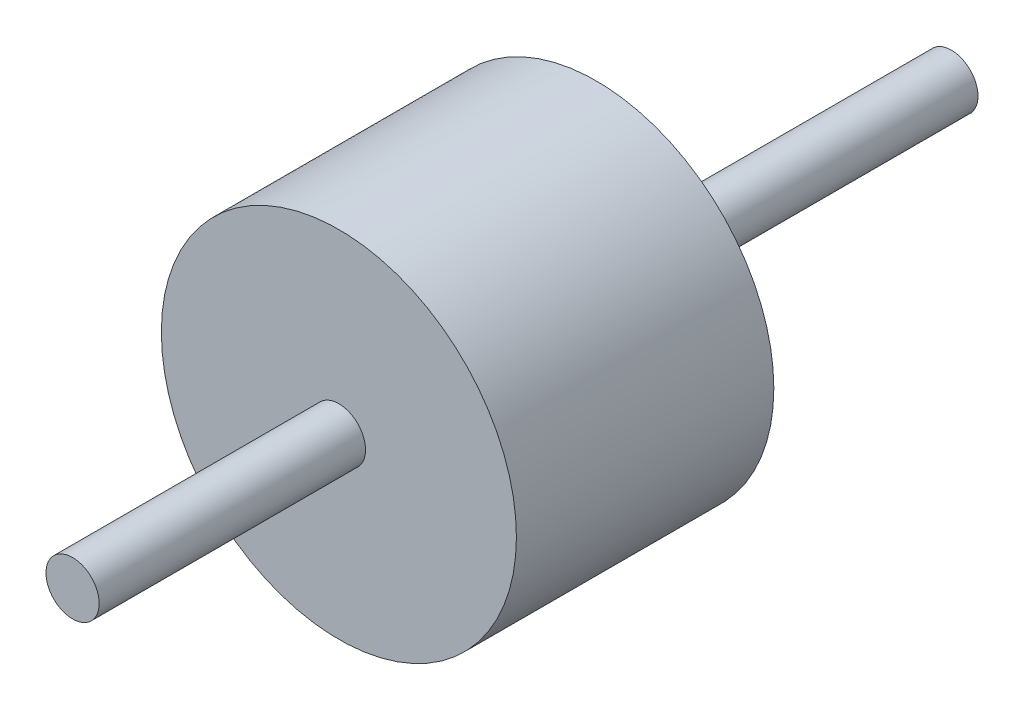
ISO-10303-21;
HEADER;
FILE_DESCRIPTION(('STEP AP214'),'2;1');
FILE_NAME('part.step','',(''),(''),'','','');
FILE_SCHEMA(('AUTOMOTIVE_DESIGN { 1 0 10303 214 1 1 1 1 }'));
ENDSEC;
DATA;
#1=APPLICATION_CONTEXT('core data for automotive mechanical design processes');
#2=APPLICATION_PROTOCOL_DEFINITION('international standard','automotive_design',2000,#1);
#3=PRODUCT_CONTEXT('',#1,'mechanical');
#4=PRODUCT('Part','Part','',(#3));
#5=PRODUCT_RELATED_PRODUCT_CATEGORY('part','',(#4));
#6=PRODUCT_DEFINITION_FORMATION('','',#4);
#7=PRODUCT_DEFINITION_CONTEXT('part definition',#1,'design');
#8=PRODUCT_DEFINITION('design','',#6,#7);
#9=PRODUCT_DEFINITION_SHAPE('','',#8);
#10=(LENGTH_UNIT() NAMED_UNIT(*) SI_UNIT(.MILLI.,.METRE.));
#11=(NAMED_UNIT(*) PLANE_ANGLE_UNIT() SI_UNIT($,.RADIAN.));
#12=(NAMED_UNIT(*) SI_UNIT($,.STERADIAN.) SOLID_ANGLE_UNIT());
#13=UNCERTAINTY_MEASURE_WITH_UNIT(LENGTH_MEASURE(1.E-05),#10,'distance_accuracy_value','');
#14=(GEOMETRIC_REPRESENTATION_CONTEXT(3) GLOBAL_UNCERTAINTY_ASSIGNED_CONTEXT((#13)) GLOBAL_UNIT_ASSIGNED_CONTEXT((#10,
#11,#12)) REPRESENTATION_CONTEXT('',''));
#15=CARTESIAN_POINT('',(0.,0.,0.));
#16=DIRECTION('',(0.,0.,1.));
#17=DIRECTION('',(1.,0.,0.));
#18=AXIS2_PLACEMENT_3D('',#15,#16,#17);
#19=CARTESIAN_POINT('',(0.,0.,0.));
#20=DIRECTION('',(0.,0.,1.));
#21=DIRECTION('',(1.,0.,0.));
#22=AXIS2_PLACEMENT_3D('',#19,#20,#21);
#23=PLANE('',#22);
#24=CARTESIAN_POINT('',(0.,0.,0.));
#25=DIRECTION('',(0.,0.,1.));
#26=DIRECTION('',(1.,0.,0.));
#27=AXIS2_PLACEMENT_3D('',#24,#25,#26);
#28=CIRCLE('',#27,1.);
#29=CARTESIAN_POINT('',(1.,0.,0.));
#30=VERTEX_POINT('',#29);
#31=EDGE_CURVE('E44',#30,#30,#28,.T.);
#32=ORIENTED_EDGE('',*,*,#31,.F.);
#33=EDGE_LOOP('',(#32));
#34=FACE_BOUND('',#33,.T.);
#35=CARTESIAN_POINT('',(0.,0.,0.));
#36=DIRECTION('',(0.,0.,1.));
#37=DIRECTION('',(1.,0.,0.));
#38=AXIS2_PLACEMENT_3D('',#35,#36,#37);
#39=CIRCLE('',#38,0.15);
#40=CARTESIAN_POINT('',(0.15,0.,0.));
#41=VERTEX_POINT('',#40);
#42=EDGE_CURVE('E10',#41,#41,#39,.F.);
#43=ORIENTED_EDGE('',*,*,#42,.F.);
#44=EDGE_LOOP('',(#43));
#45=FACE_BOUND('',#44,.T.);
#46=ADVANCED_FACE('F33',(#34,#45),#23,.F.);
#47=CARTESIAN_POINT('',(0.,0.,1.45));
#48=DIRECTION('',(0.,0.,1.));
#49=DIRECTION('',(1.,0.,0.));
#50=AXIS2_PLACEMENT_3D('',#47,#48,#49);
#51=PLANE('',#50);
#52=CARTESIAN_POINT('',(0.,0.,1.45));
#53=DIRECTION('',(0.,0.,1.));
#54=DIRECTION('',(1.,0.,0.));
#55=AXIS2_PLACEMENT_3D('',#52,#53,#54);
#56=CIRCLE('',#55,1.);
#57=CARTESIAN_POINT('',(1.,0.,1.45));
#58=VERTEX_POINT('',#57);
#59=EDGE_CURVE('E40',#58,#58,#56,.T.);
#60=ORIENTED_EDGE('',*,*,#59,.T.);
#61=EDGE_LOOP('',(#60));
#62=FACE_BOUND('',#61,.T.);
#63=CARTESIAN_POINT('',(0.,0.,1.45));
#64=DIRECTION('',(0.,0.,1.));
#65=DIRECTION('',(1.,0.,0.));
#66=AXIS2_PLACEMENT_3D('',#63,#64,#65);
#67=CIRCLE('',#66,0.15);
#68=CARTESIAN_POINT('',(0.15,0.,1.45));
#69=VERTEX_POINT('',#68);
#70=EDGE_CURVE('E51',#69,#69,#67,.T.);
#71=ORIENTED_EDGE('',*,*,#70,.F.);
#72=EDGE_LOOP('',(#71));
#73=FACE_BOUND('',#72,.T.);
#74=ADVANCED_FACE('F75',(#62,#73),#51,.T.);
#75=CARTESIAN_POINT('',(0.,0.,1.45));
#76=DIRECTION('',(0.,0.,-1.));
#77=DIRECTION('',(-1.,0.,0.));
#78=AXIS2_PLACEMENT_3D('',#75,#76,#77);
#79=CYLINDRICAL_SURFACE('',#78,1.);
#80=ORIENTED_EDGE('',*,*,#59,.F.);
#81=EDGE_LOOP('',(#80));
#82=FACE_BOUND('',#81,.T.);
#83=ORIENTED_EDGE('',*,*,#31,.T.);
#84=EDGE_LOOP('',(#83));
#85=FACE_BOUND('',#84,.T.);
#86=ADVANCED_FACE('F35',(#82,#85),#79,.T.);
#87=CARTESIAN_POINT('',(0.,0.,2.95));
#88=DIRECTION('',(0.,0.,-1.));
#89=DIRECTION('',(-1.,0.,0.));
#90=AXIS2_PLACEMENT_3D('',#87,#88,#89);
#91=CYLINDRICAL_SURFACE('',#90,0.15);
#92=CARTESIAN_POINT('',(0.,0.,2.95));
#93=DIRECTION('',(0.,0.,1.));
#94=DIRECTION('',(1.,0.,0.));
#95=AXIS2_PLACEMENT_3D('',#92,#93,#94);
#96=CIRCLE('',#95,0.15);
#97=CARTESIAN_POINT('',(0.15,0.,2.95));
#98=VERTEX_POINT('',#97);
#99=EDGE_CURVE('E49',#98,#98,#96,.T.);
#100=ORIENTED_EDGE('',*,*,#99,.F.);
#101=EDGE_LOOP('',(#100));
#102=FACE_BOUND('',#101,.T.);
#103=ORIENTED_EDGE('',*,*,#70,.T.);
#104=EDGE_LOOP('',(#103));
#105=FACE_BOUND('',#104,.T.);
#106=ADVANCED_FACE('F71',(#102,#105),#91,.T.);
#107=CARTESIAN_POINT('',(0.,0.,2.95));
#108=DIRECTION('',(0.,0.,1.));
#109=DIRECTION('',(1.,0.,0.));
#110=AXIS2_PLACEMENT_3D('',#107,#108,#109);
#111=PLANE('',#110);
#112=ORIENTED_EDGE('',*,*,#99,.T.);
#113=EDGE_LOOP('',(#112));
#114=FACE_BOUND('',#113,.T.);
#115=ADVANCED_FACE('F64',(#114),#111,.T.);
#116=CARTESIAN_POINT('',(0.,0.,-2.));
#117=DIRECTION('',(0.,0.,1.));
#118=DIRECTION('',(1.,0.,0.));
#119=AXIS2_PLACEMENT_3D('',#116,#117,#118);
#120=CYLINDRICAL_SURFACE('',#119,0.15);
#121=CARTESIAN_POINT('',(0.,0.,-2.));
#122=DIRECTION('',(0.,0.,-1.));
#123=DIRECTION('',(-1.,0.,0.));
#124=AXIS2_PLACEMENT_3D('',#121,#122,#123);
#125=CIRCLE('',#124,0.15);
#126=CARTESIAN_POINT('',(-0.15,0.,-2.));
#127=VERTEX_POINT('',#126);
#128=EDGE_CURVE('E54',#127,#127,#125,.T.);
#129=ORIENTED_EDGE('',*,*,#128,.F.);
#130=EDGE_LOOP('',(#129));
#131=FACE_BOUND('',#130,.T.);
#132=ORIENTED_EDGE('',*,*,#42,.T.);
#133=EDGE_LOOP('',(#132));
#134=FACE_BOUND('',#133,.T.);
#135=ADVANCED_FACE('F62',(#131,#134),#120,.T.);
#136=CARTESIAN_POINT('',(0.,0.,-2.));
#137=DIRECTION('',(0.,0.,-1.));
#138=DIRECTION('',(-1.,0.,0.));
#139=AXIS2_PLACEMENT_3D('',#136,#137,#138);
#140=PLANE('',#139);
#141=ORIENTED_EDGE('',*,*,#128,.T.);
#142=EDGE_LOOP('',(#141));
#143=FACE_BOUND('',#142,.T.);
#144=ADVANCED_FACE('F60',(#143),#140,.T.);
#145=CLOSED_SHELL('',(#46,#74,#86,#106,#115,#135,#144));
#146=MANIFOLD_SOLID_BREP('B2',#145);
#147=ADVANCED_BREP_SHAPE_REPRESENTATION('',(#18,#146),#14);
#148=SHAPE_DEFINITION_REPRESENTATION(#9,#147);
ENDSEC;
END-ISO-10303-21;
